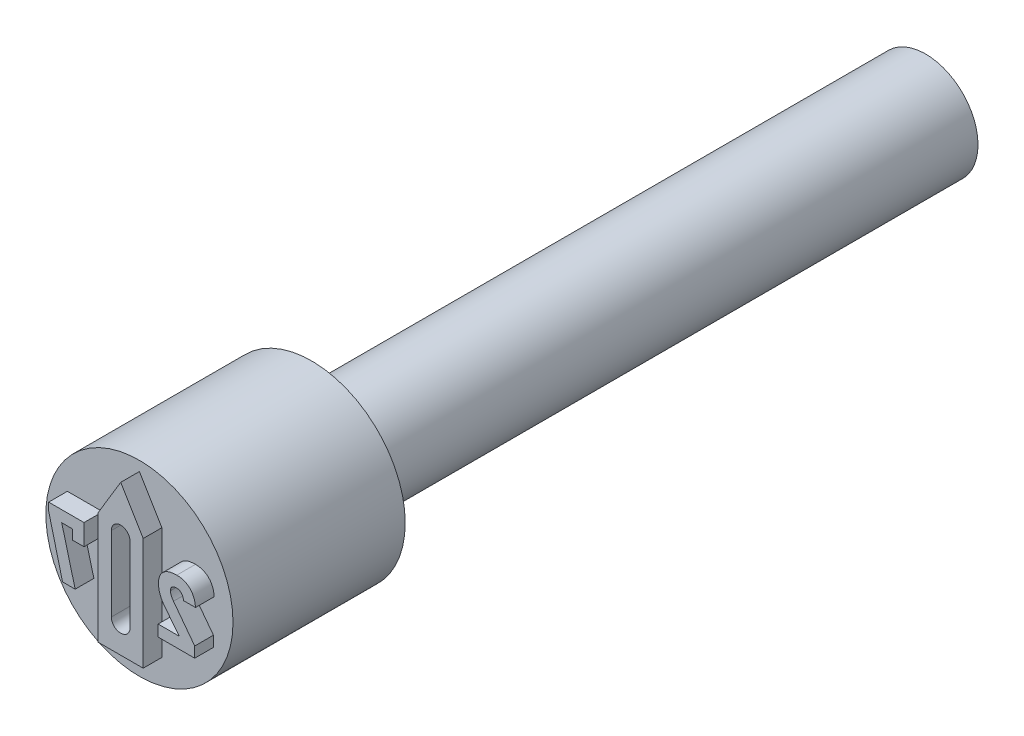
from build123d import *

# Parameters (mm, degrees)
BOSS_EXTRUDE1_DEPTH = 0.25
CUT_EXTRUDE1_DEPTH  = 0.25


with BuildPart() as part:
    # Sketch2 → Revolve1 (revolve)
    with BuildSketch(Plane(origin=(0, 0, 0), x_dir=(0, 0, -1), z_dir=(1, 0, 0)), mode=Mode.PRIVATE) as revolve1_sk:
        Polygon((0, 1.25), (0, 0), (10.5, 0), (10.5, 0.7), (2.3, 0.7), (2.3, 1.25), align=None)
    revolve(revolve1_sk.sketch.rotate(Axis((0, 0, -0.403888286), (0, 0, -1)), 90), axis=Axis((0, 0, -0.403888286), (0, 0, -1)))

    # Sketch3 → Boss-Extrude1 (add)
    with BuildSketch(Plane.XY):
        Polygon((-0.3, -0.88), (0.3, -0.88), (0.3, 0.62), (0, 1.12), (-0.3, 0.621430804), align=None)
        with BuildLine():
            Line((0.988524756, -0.42), (0.988524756, -0.278859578))
            Line((0.988524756, -0.278859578), (0.70489651, 0.096897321))
            add(Edge.make_bspline(
                [(0.70489651, 0.096897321), (0.698955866, 0.105268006), (0.687380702, 0.121578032), (0.676904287, 0.143976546), (0.670377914, 0.161537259), (0.667267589, 0.174272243), (0.665048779, 0.18642261), (0.664775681, 0.194406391), (0.664642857, 0.198289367)],
                knots=[0, 0, 0, 0, 1.664252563, 3.24274559, 3.998498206, 4.704056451, 5.369707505, 6, 6, 6, 6], degree=3))
            Line((0.664642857, 0.198289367), (0.664642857, 0.199468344))
            add(Edge.make_bspline(
                [(0.664642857, 0.199468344), (0.664872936, 0.204775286), (0.66531373, 0.214942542), (0.669466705, 0.229268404), (0.676273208, 0.241744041), (0.686021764, 0.252048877), (0.698157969, 0.260199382), (0.712679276, 0.265943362), (0.729395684, 0.269237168), (0.741260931, 0.269651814), (0.747508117, 0.26987013)],
                knots=[0, 0, 0, 0, 1.029992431, 1.973301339, 2.872554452, 3.768620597, 4.704316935, 5.693697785, 6.785705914, 8, 8, 8, 8], degree=3))
            add(Edge.make_bspline(
                [(0.747508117, 0.26987013), (0.753609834, 0.26963204), (0.765465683, 0.269169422), (0.782249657, 0.264042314), (0.797373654, 0.256000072), (0.810411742, 0.244524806), (0.821208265, 0.230117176), (0.829970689, 0.213151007), (0.835922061, 0.193319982), (0.838027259, 0.17912423), (0.839131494, 0.171678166)],
                knots=[0, 0, 0, 0, 0.980828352, 1.905783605, 2.800718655, 3.724477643, 4.680224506, 5.688112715, 6.78735127, 8, 8, 8, 8], degree=3))
            Line((0.839131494, 0.171678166), (0.998798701, 0.17117289))
            add(Edge.make_bspline(
                [(0.998798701, 0.17117289), (0.998010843, 0.181299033), (0.996472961, 0.200078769), (0.991431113, 0.227244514), (0.984914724, 0.252832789), (0.976624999, 0.276838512), (0.965972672, 0.298983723), (0.954004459, 0.319731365), (0.939609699, 0.338439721), (0.923852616, 0.355734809), (0.906302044, 0.370968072), (0.887588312, 0.384405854), (0.867428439, 0.395588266), (0.846128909, 0.404864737), (0.823453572, 0.411905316), (0.799698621, 0.417179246), (0.774591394, 0.420220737), (0.757453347, 0.420590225), (0.748687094, 0.420779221)],
                knots=[0, 0, 0, 0, 1.173229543, 2.290119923, 3.354877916, 4.382703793, 5.372196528, 6.339367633, 7.289741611, 8.236749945, 9.180232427, 10.11040526, 11.033485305, 11.978374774, 12.930610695, 13.916256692, 14.93414813, 16, 16, 16, 16], degree=3))
            add(Edge.make_bspline(
                [(0.748687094, 0.420779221), (0.739247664, 0.420645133), (0.720889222, 0.420384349), (0.694162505, 0.417569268), (0.6690155, 0.41332049), (0.64548867, 0.407104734), (0.623676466, 0.398996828), (0.603513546, 0.38922069), (0.584957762, 0.377693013), (0.568151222, 0.364389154), (0.553029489, 0.349550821), (0.540013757, 0.333027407), (0.528746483, 0.315152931), (0.519938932, 0.2955807), (0.512687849, 0.274770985), (0.507992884, 0.252350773), (0.504829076, 0.228584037), (0.504480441, 0.212223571), (0.504301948, 0.203847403)],
                knots=[0, 0, 0, 0, 1.219700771, 2.37215663, 3.469774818, 4.513610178, 5.512457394, 6.473141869, 7.405450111, 8.330272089, 9.238546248, 10.1372905, 11.043445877, 11.962355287, 12.905558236, 13.886315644, 14.917844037, 16, 16, 16, 16], degree=3))
            add(Edge.make_bspline(
                [(0.504301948, 0.203847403), (0.504516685, 0.193729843), (0.504946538, 0.174825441), (0.508826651, 0.146532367), (0.515079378, 0.118383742), (0.52366658, 0.090515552), (0.534334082, 0.063410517), (0.547137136, 0.03743984), (0.561587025, 0.01259203), (0.573037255, -0.002743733), (0.578745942, -0.01038961)],
                knots=[0, 0, 0, 0, 0.984368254, 1.970475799, 2.971844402, 3.988480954, 5.008197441, 6.005725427, 7.005724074, 8, 8, 8, 8], degree=3))
            Line((0.578745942, -0.01038961), (0.782203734, -0.269090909))
            Line((0.782203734, -0.269090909), (0.499754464, -0.269090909))
            Line((0.499754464, -0.269090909), (0.499754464, -0.42))
            Line((0.499754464, -0.42), (0.988524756, -0.42))
        make_face()
        Polygon((-0.962291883, 0.41), (-0.962291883, 0.305913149), (-0.777024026, -0.42), (-0.608261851, -0.42), (-0.787803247, 0.259090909), (-0.645820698, 0.259090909), (-0.645820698, 0.12974026), (-0.490027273, 0.12974026), (-0.490027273, 0.41), align=None)
    extrude(amount=BOSS_EXTRUDE1_DEPTH)

    # Sketch4 → Cut-Extrude1 (cut)
    with BuildSketch(Plane.XY.offset(0.25)):
        with BuildLine():
            Line((-0.125, 0.5), (-0.125, -0.5))
            ThreePointArc((-0.125, -0.5), (0, -0.625), (0.125, -0.5))
            Line((0.125, -0.5), (0.125, 0.5))
            ThreePointArc((0.125, 0.5), (0, 0.625), (-0.125, 0.5))
        make_face()
    extrude(amount=-CUT_EXTRUDE1_DEPTH, mode=Mode.SUBTRACT)


solid = part.part
